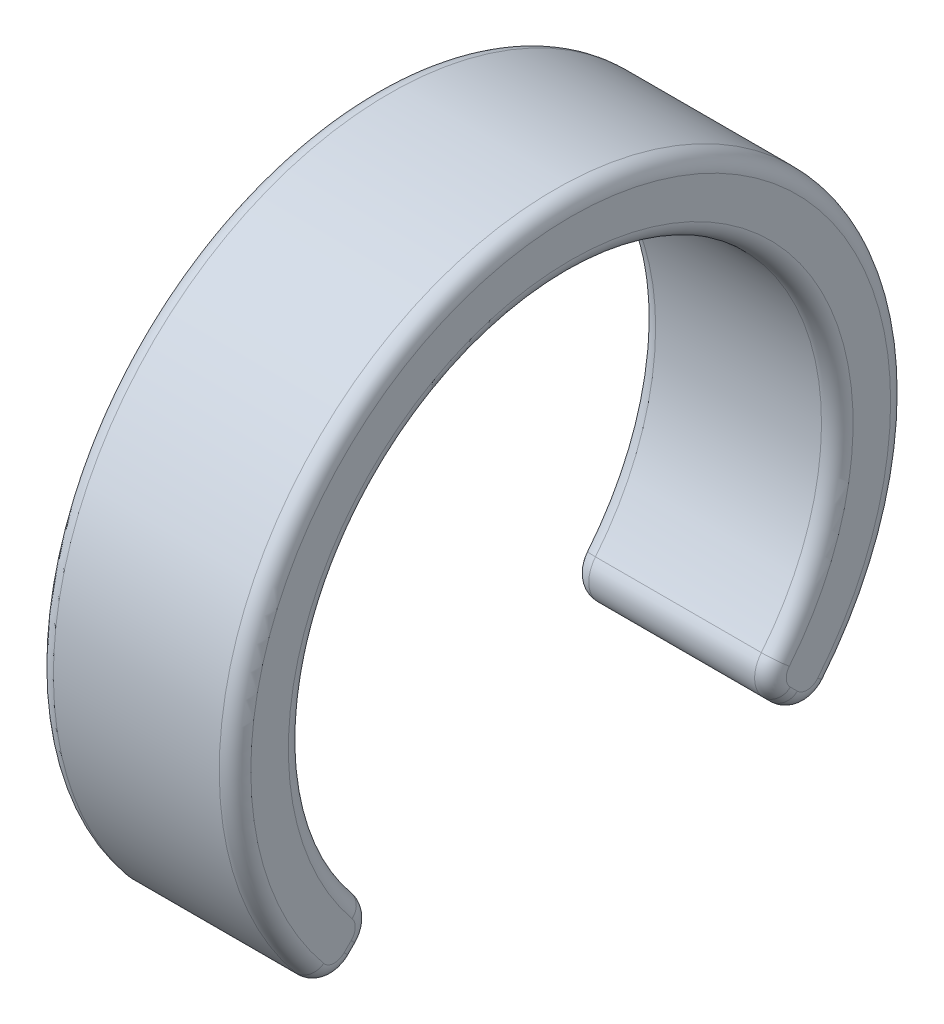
from build123d import *

# Parameters (mm, degrees)
SKIZZE1_W       = 10
SKIZZE1_H       = 3.5
ROTATION1_ANGLE = 270
VERRUNDUNG1_R   = 1.5
VERRUNDUNG2_R   = 0.8


with BuildPart() as part:
    # Skizze1 → Rotation1 (revolve, symmetric)
    with BuildSketch(Plane.XY) as rotation1_sk:
        with Locations((0, 15.25)):
            Rectangle(SKIZZE1_W, SKIZZE1_H)
    revolve(axis=Axis((-29.230918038, 0, 0), (1, 0, 0)), revolution_arc=ROTATION1_ANGLE / 2)
    revolve(rotation1_sk.sketch, axis=Axis((-29.230918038, 0, 0), (-1, 0, 0)), revolution_arc=ROTATION1_ANGLE / 2)

    # Verrundung1
    verrundung1_edges = [part.edges().sort_by_distance(p)[0] for p in [
        (0, -9.545941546, 9.545941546),
        (0, -12.02081528, -12.02081528),
        (0, -9.545941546, -9.545941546),
        (0, -12.02081528, 12.02081528),
    ]]
    fillet(verrundung1_edges, radius=VERRUNDUNG1_R)

    # Verrundung2
    verrundung2_edges = [part.edges().sort_by_distance(p)[0] for p in [
        (5, 17, 0),
        (-5, 17, 0),
        (-5, -10.731073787, -10.731073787),
        (-5, 13.5, 0),
        (-5, -10.731073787, 10.731073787),
        (-5, -11.346290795, 12.042038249),
        (-5, -9.56786945, 10.115976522),
        (-5, -9.56786945, -10.115976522),
        (-5, -11.346290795, -12.042038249),
        (5, -10.731073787, -10.731073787),
        (5, 13.5, 0),
        (5, -10.731073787, 10.731073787),
        (5, -11.346290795, 12.042038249),
        (5, -9.56786945, 10.115976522),
        (5, -9.56786945, -10.115976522),
        (5, -11.346290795, -12.042038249),
    ]]
    fillet(verrundung2_edges, radius=VERRUNDUNG2_R)


solid = part.part
